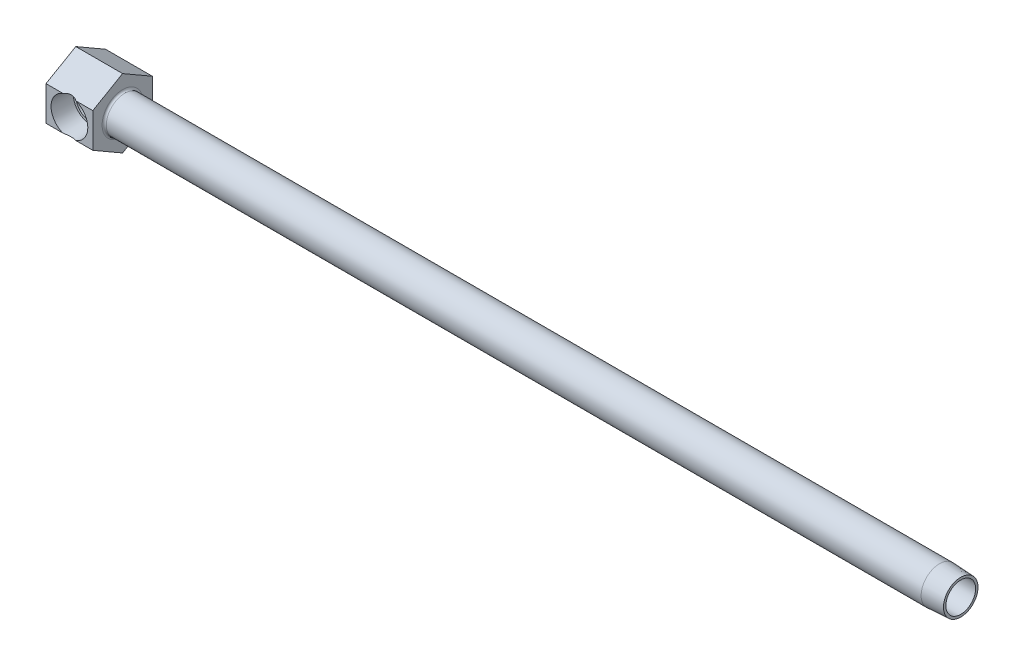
ISO-10303-21;
HEADER;
FILE_DESCRIPTION(('STEP AP214'),'2;1');
FILE_NAME('part.step','',(''),(''),'','','');
FILE_SCHEMA(('AUTOMOTIVE_DESIGN { 1 0 10303 214 1 1 1 1 }'));
ENDSEC;
DATA;
#1=APPLICATION_CONTEXT('core data for automotive mechanical design processes');
#2=APPLICATION_PROTOCOL_DEFINITION('international standard','automotive_design',2000,#1);
#3=PRODUCT_CONTEXT('',#1,'mechanical');
#4=PRODUCT('Part','Part','',(#3));
#5=PRODUCT_RELATED_PRODUCT_CATEGORY('part','',(#4));
#6=PRODUCT_DEFINITION_FORMATION('','',#4);
#7=PRODUCT_DEFINITION_CONTEXT('part definition',#1,'design');
#8=PRODUCT_DEFINITION('design','',#6,#7);
#9=PRODUCT_DEFINITION_SHAPE('','',#8);
#10=(LENGTH_UNIT() NAMED_UNIT(*) SI_UNIT(.MILLI.,.METRE.));
#11=(NAMED_UNIT(*) PLANE_ANGLE_UNIT() SI_UNIT($,.RADIAN.));
#12=(NAMED_UNIT(*) SI_UNIT($,.STERADIAN.) SOLID_ANGLE_UNIT());
#13=UNCERTAINTY_MEASURE_WITH_UNIT(LENGTH_MEASURE(1.E-05),#10,'distance_accuracy_value','');
#14=(GEOMETRIC_REPRESENTATION_CONTEXT(3) GLOBAL_UNCERTAINTY_ASSIGNED_CONTEXT((#13)) GLOBAL_UNIT_ASSIGNED_CONTEXT((#10,
#11,#12)) REPRESENTATION_CONTEXT('',''));
#15=CARTESIAN_POINT('',(0.,0.,0.));
#16=DIRECTION('',(0.,0.,1.));
#17=DIRECTION('',(1.,0.,0.));
#18=AXIS2_PLACEMENT_3D('',#15,#16,#17);
#19=CARTESIAN_POINT('',(63.5,0.,11.1125));
#20=DIRECTION('',(-1.,0.,0.));
#21=DIRECTION('',(0.,0.,1.));
#22=AXIS2_PLACEMENT_3D('',#19,#20,#21);
#23=CYLINDRICAL_SURFACE('',#22,6.858);
#24=CARTESIAN_POINT('',(18.2499,0.,11.1125));
#25=DIRECTION('',(-1.,0.,0.));
#26=DIRECTION('',(0.,-1.,0.));
#27=AXIS2_PLACEMENT_3D('',#24,#25,#26);
#28=CIRCLE('',#27,6.858);
#29=CARTESIAN_POINT('',(18.2499,-6.858,11.1125));
#30=VERTEX_POINT('',#29);
#31=EDGE_CURVE('E22',#30,#30,#28,.F.);
#32=ORIENTED_EDGE('',*,*,#31,.T.);
#33=EDGE_LOOP('',(#32));
#34=FACE_BOUND('',#33,.T.);
#35=CARTESIAN_POINT('',(322.2752,0.,11.1125));
#36=DIRECTION('',(1.,0.,0.));
#37=DIRECTION('',(0.,0.,-1.));
#38=AXIS2_PLACEMENT_3D('',#35,#36,#37);
#39=CIRCLE('',#38,6.858);
#40=CARTESIAN_POINT('',(322.2752,0.,4.2545));
#41=VERTEX_POINT('',#40);
#42=EDGE_CURVE('E156',#41,#41,#39,.T.);
#43=ORIENTED_EDGE('',*,*,#42,.F.);
#44=EDGE_LOOP('',(#43));
#45=FACE_BOUND('',#44,.T.);
#46=ADVANCED_FACE('F15',(#34,#45),#23,.T.);
#47=CARTESIAN_POINT('',(8.7376,0.,22.225));
#48=DIRECTION('',(0.,0.,1.));
#49=DIRECTION('',(1.,0.,0.));
#50=AXIS2_PLACEMENT_3D('',#47,#48,#49);
#51=CONICAL_SURFACE('',#50,6.858,0.0523598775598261);
#52=CARTESIAN_POINT('',(8.7376,-0.680996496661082,34.5170205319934));
#53=DIRECTION('',(0.,-0.866025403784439,-0.5));
#54=DIRECTION('',(0.,-0.5,0.866025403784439));
#55=AXIS2_PLACEMENT_3D('',#52,#53,#54);
#56=ELLIPSE('',#55,15.0043949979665,7.47122554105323);
#57=CARTESIAN_POINT('',(11.1603281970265,6.4158048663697,22.225));
#58=VERTEX_POINT('',#57);
#59=CARTESIAN_POINT('',(6.3148718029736,6.4158048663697,22.225));
#60=VERTEX_POINT('',#59);
#61=EDGE_CURVE('E232',#58,#60,#56,.F.);
#62=ORIENTED_EDGE('',*,*,#61,.T.);
#63=CARTESIAN_POINT('',(8.7376,0.,22.225));
#64=DIRECTION('',(0.,0.,-1.));
#65=DIRECTION('',(-1.,0.,0.));
#66=AXIS2_PLACEMENT_3D('',#63,#64,#65);
#67=CIRCLE('',#66,6.858);
#68=CARTESIAN_POINT('',(6.31487180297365,-6.41580486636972,22.225));
#69=VERTEX_POINT('',#68);
#70=EDGE_CURVE('E36',#69,#60,#67,.T.);
#71=ORIENTED_EDGE('',*,*,#70,.F.);
#72=CARTESIAN_POINT('',(8.7376,0.680996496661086,34.5170205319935));
#73=DIRECTION('',(0.,0.866025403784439,-0.5));
#74=DIRECTION('',(0.,0.5,0.866025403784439));
#75=AXIS2_PLACEMENT_3D('',#72,#73,#74);
#76=ELLIPSE('',#75,15.0043949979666,7.47122554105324);
#77=CARTESIAN_POINT('',(11.1603281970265,-6.4158048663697,22.225));
#78=VERTEX_POINT('',#77);
#79=EDGE_CURVE('E10',#69,#78,#76,.F.);
#80=ORIENTED_EDGE('',*,*,#79,.T.);
#81=EDGE_CURVE('E249',#58,#78,#67,.T.);
#82=ORIENTED_EDGE('',*,*,#81,.F.);
#83=EDGE_LOOP('',(#62,#71,#80,#82));
#84=FACE_BOUND('',#83,.T.);
#85=CARTESIAN_POINT('',(8.7376,0.,14.3002));
#86=DIRECTION('',(0.,0.,-1.));
#87=DIRECTION('',(-1.,0.,0.));
#88=AXIS2_PLACEMENT_3D('',#85,#86,#87);
#89=CIRCLE('',#88,6.44267883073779);
#90=CARTESIAN_POINT('',(13.3057672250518,-4.54312213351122,14.3002));
#91=VERTEX_POINT('',#90);
#92=CARTESIAN_POINT('',(13.3057672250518,4.54312213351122,14.3002));
#93=VERTEX_POINT('',#92);
#94=EDGE_CURVE('E251',#91,#93,#89,.T.);
#95=ORIENTED_EDGE('',*,*,#94,.T.);
#96=CARTESIAN_POINT('',(13.3056128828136,4.54326245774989,14.3));
#97=CARTESIAN_POINT('',(13.4050037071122,4.45290836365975,14.4287190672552));
#98=CARTESIAN_POINT('',(13.5038252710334,4.35690222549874,14.5539811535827));
#99=CARTESIAN_POINT('',(13.6989301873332,4.15324987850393,14.7972290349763));
#100=CARTESIAN_POINT('',(13.7952093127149,4.04558563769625,14.9152031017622));
#101=CARTESIAN_POINT('',(13.9843700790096,3.81752411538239,15.1441485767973));
#102=CARTESIAN_POINT('',(14.0772125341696,3.69701926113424,15.25504596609));
#103=CARTESIAN_POINT('',(14.2568464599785,3.44414434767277,15.4675620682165));
#104=CARTESIAN_POINT('',(14.3436418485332,3.31178210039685,15.5691868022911));
#105=CARTESIAN_POINT('',(14.5527686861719,2.962976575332,15.8122617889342));
#106=CARTESIAN_POINT('',(14.6701286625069,2.73858307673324,15.9469651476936));
#107=CARTESIAN_POINT('',(14.8276174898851,2.38307262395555,16.1264780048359));
#108=CARTESIAN_POINT('',(14.8769849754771,2.2615363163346,16.1825173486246));
#109=CARTESIAN_POINT('',(14.9687772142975,2.0125151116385,16.2864098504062));
#110=CARTESIAN_POINT('',(15.0112056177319,1.88503338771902,16.3342673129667));
#111=CARTESIAN_POINT('',(15.088733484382,1.6232487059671,16.4215218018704));
#112=CARTESIAN_POINT('',(15.1237419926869,1.48888366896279,16.4608139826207));
#113=CARTESIAN_POINT('',(15.1849785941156,1.21573970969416,16.5294343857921));
#114=CARTESIAN_POINT('',(15.2112114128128,1.0769632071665,16.5587679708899));
#115=CARTESIAN_POINT('',(15.2542466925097,0.796159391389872,16.6068431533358));
#116=CARTESIAN_POINT('',(15.2710505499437,0.654132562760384,16.6255863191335));
#117=CARTESIAN_POINT('',(15.2947665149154,0.368243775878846,16.6520290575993));
#118=CARTESIAN_POINT('',(15.3016803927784,0.22438215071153,16.6597306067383));
#119=CARTESIAN_POINT('',(15.3051381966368,-0.0413792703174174,16.6635827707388));
#120=CARTESIAN_POINT('',(15.3031178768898,-0.163241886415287,16.6613326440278));
#121=CARTESIAN_POINT('',(15.2919140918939,-0.406265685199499,16.6488476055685));
#122=CARTESIAN_POINT('',(15.282728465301,-0.527426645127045,16.6386102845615));
#123=CARTESIAN_POINT('',(15.2573805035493,-0.768029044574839,16.6103343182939));
#124=CARTESIAN_POINT('',(15.2412218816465,-0.88747136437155,16.5922998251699));
#125=CARTESIAN_POINT('',(15.2022471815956,-1.1238947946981,16.5487418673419));
#126=CARTESIAN_POINT('',(15.1794285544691,-1.24087494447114,16.5232155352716));
#127=CARTESIAN_POINT('',(15.1030013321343,-1.58064044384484,16.4375716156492));
#128=CARTESIAN_POINT('',(15.0406598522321,-1.79907617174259,16.3675454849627));
#129=CARTESIAN_POINT('',(14.8959772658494,-2.2198653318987,16.2041288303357));
#130=CARTESIAN_POINT('',(14.8136249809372,-2.42220969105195,16.1107252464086));
#131=CARTESIAN_POINT('',(14.6581620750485,-2.75475802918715,15.9330467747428));
#132=CARTESIAN_POINT('',(14.588877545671,-2.88934500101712,15.8534887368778));
#133=CARTESIAN_POINT('',(14.4433958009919,-3.14876465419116,15.6853070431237));
#134=CARTESIAN_POINT('',(14.3671982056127,-3.27359679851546,15.5966828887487));
#135=CARTESIAN_POINT('',(14.2091096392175,-3.51355050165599,15.4112660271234));
#136=CARTESIAN_POINT('',(14.1272094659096,-3.62865566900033,15.3144600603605));
#137=CARTESIAN_POINT('',(13.9591121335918,-3.84892561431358,15.1136697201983));
#138=CARTESIAN_POINT('',(13.8729164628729,-3.95409379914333,15.0096878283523));
#139=CARTESIAN_POINT('',(13.7069469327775,-4.14374167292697,14.806812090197));
#140=CARTESIAN_POINT('',(13.62749258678,-4.22922772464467,14.7085925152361));
#141=CARTESIAN_POINT('',(13.4673498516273,-4.39212627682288,14.5076746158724));
#142=CARTESIAN_POINT('',(13.386669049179,-4.46957495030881,14.404999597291));
#143=CARTESIAN_POINT('',(13.3056128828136,-4.54326245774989,14.3));
#144=B_SPLINE_CURVE_WITH_KNOTS('',3,(#96,#97,#98,#99,#100,#101,#102,#103,#104,#105,#106,#107,
#108,#109,#110,#111,#112,#113,#114,#115,#116,#117,#118,#119,#120,#121,#122,#123,#124,#125,#126,
#127,#128,#129,#130,#131,#132,#133,#134,#135,#136,#137,#138,#139,#140,#141,#142,#143),
.UNSPECIFIED.,.F.,.F.,(4,2,2,2,2,2,2,2,2,2,2,2,2,2,2,2,2,2,2,2,2,2,2,4),(0.,0.55807217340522,
1.11702021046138,1.68108674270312,2.24478434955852,3.10140634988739,3.52893103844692,
3.95623010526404,4.38849766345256,4.82053207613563,5.25250248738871,5.68439556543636,
6.04963287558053,6.41498039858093,6.78013360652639,7.14542675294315,7.85550743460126,
8.56598569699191,9.07835413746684,9.59075076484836,10.1039943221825,10.6170612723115,
11.0743952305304,11.5295724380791),.UNSPECIFIED.);
#145=EDGE_CURVE('E130',#93,#91,#144,.T.);
#146=ORIENTED_EDGE('',*,*,#145,.T.);
#147=EDGE_LOOP('',(#95,#146));
#148=FACE_BOUND('',#147,.T.);
#149=ADVANCED_FACE('F138',(#84,#148),#51,.F.);
#150=CARTESIAN_POINT('',(15.1802788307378,0.,14.3002));
#151=DIRECTION('',(0.,0.,1.));
#152=DIRECTION('',(1.,0.,0.));
#153=AXIS2_PLACEMENT_3D('',#150,#151,#152);
#154=PLANE('',#153);
#155=ORIENTED_EDGE('',*,*,#94,.F.);
#156=DIRECTION('',(1.,0.,0.));
#157=VECTOR('',#156,1.);
#158=CARTESIAN_POINT('',(65.6255637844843,-4.54312213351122,14.3002));
#159=LINE('',#158,#157);
#160=CARTESIAN_POINT('',(11.9253,-4.54312213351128,14.3002));
#161=VERTEX_POINT('',#160);
#162=EDGE_CURVE('E128',#91,#161,#159,.F.);
#163=ORIENTED_EDGE('',*,*,#162,.T.);
#164=CARTESIAN_POINT('',(8.7376,0.,14.3002));
#165=DIRECTION('',(0.,0.,-1.));
#166=DIRECTION('',(-1.,0.,0.));
#167=AXIS2_PLACEMENT_3D('',#164,#165,#166);
#168=CIRCLE('',#167,5.5499);
#169=CARTESIAN_POINT('',(11.9253,4.54312213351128,14.3002));
#170=VERTEX_POINT('',#169);
#171=EDGE_CURVE('E120',#161,#170,#168,.T.);
#172=ORIENTED_EDGE('',*,*,#171,.T.);
#173=DIRECTION('',(1.,0.,0.));
#174=VECTOR('',#173,1.);
#175=CARTESIAN_POINT('',(65.6255637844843,4.54312213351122,14.3002));
#176=LINE('',#175,#174);
#177=EDGE_CURVE('E123',#170,#93,#176,.T.);
#178=ORIENTED_EDGE('',*,*,#177,.T.);
#179=EDGE_LOOP('',(#155,#163,#172,#178));
#180=FACE_BOUND('',#179,.T.);
#181=ADVANCED_FACE('F181',(#180),#154,.T.);
#182=CARTESIAN_POINT('',(8.7376,0.,27.6280516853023));
#183=DIRECTION('',(0.,0.,-1.));
#184=DIRECTION('',(-1.,0.,0.));
#185=AXIS2_PLACEMENT_3D('',#182,#183,#184);
#186=CYLINDRICAL_SURFACE('',#185,5.5499);
#187=ORIENTED_EDGE('',*,*,#171,.F.);
#188=CARTESIAN_POINT('',(8.7376,0.,11.1125));
#189=DIRECTION('',(0.707106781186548,0.,-0.707106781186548));
#190=DIRECTION('',(-0.707106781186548,0.,-0.707106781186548));
#191=AXIS2_PLACEMENT_3D('',#188,#189,#190);
#192=ELLIPSE('',#191,7.84874384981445,5.5499);
#193=CARTESIAN_POINT('',(8.7376,-5.5499,11.1125));
#194=VERTEX_POINT('',#193);
#195=EDGE_CURVE('E109',#161,#194,#192,.T.);
#196=ORIENTED_EDGE('',*,*,#195,.T.);
#197=CARTESIAN_POINT('',(8.7376,0.,11.1125));
#198=DIRECTION('',(-0.707106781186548,0.,-0.707106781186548));
#199=DIRECTION('',(0.707106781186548,0.,-0.707106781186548));
#200=AXIS2_PLACEMENT_3D('',#197,#198,#199);
#201=ELLIPSE('',#200,7.84874384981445,5.5499);
#202=CARTESIAN_POINT('',(13.4708637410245,-2.89786203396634,6.37923625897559));
#203=VERTEX_POINT('',#202);
#204=EDGE_CURVE('E104',#194,#203,#201,.F.);
#205=ORIENTED_EDGE('',*,*,#204,.T.);
#206=CARTESIAN_POINT('',(8.7376,0.,6.37923625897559));
#207=DIRECTION('',(0.,0.,-1.));
#208=DIRECTION('',(-1.,0.,0.));
#209=AXIS2_PLACEMENT_3D('',#206,#207,#208);
#210=CIRCLE('',#209,5.5499);
#211=CARTESIAN_POINT('',(13.4708637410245,2.89786203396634,6.37923625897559));
#212=VERTEX_POINT('',#211);
#213=EDGE_CURVE('E136',#203,#212,#210,.T.);
#214=ORIENTED_EDGE('',*,*,#213,.T.);
#215=CARTESIAN_POINT('',(8.7376,5.5499,11.1125));
#216=VERTEX_POINT('',#215);
#217=EDGE_CURVE('E29',#212,#216,#201,.F.);
#218=ORIENTED_EDGE('',*,*,#217,.T.);
#219=EDGE_CURVE('E121',#216,#170,#192,.T.);
#220=ORIENTED_EDGE('',*,*,#219,.T.);
#221=EDGE_LOOP('',(#187,#196,#205,#214,#218,#220));
#222=FACE_BOUND('',#221,.T.);
#223=ADVANCED_FACE('F117',(#222),#186,.F.);
#224=CARTESIAN_POINT('',(8.7376,0.,6.37923625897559));
#225=DIRECTION('',(0.,0.,1.));
#226=DIRECTION('',(1.,0.,0.));
#227=AXIS2_PLACEMENT_3D('',#224,#225,#226);
#228=CONICAL_SURFACE('',#227,5.5499,1.04719755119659);
#229=CARTESIAN_POINT('',(8.7376,0.,3.175));
#230=VERTEX_POINT('',#229);
#231=VERTEX_LOOP('',#230);
#232=FACE_BOUND('',#231,.T.);
#233=ORIENTED_EDGE('',*,*,#213,.F.);
#234=CARTESIAN_POINT('',(13.4710699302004,-2.89818868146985,6.37943625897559));
#235=CARTESIAN_POINT('',(13.420685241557,-2.8185279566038,6.33063423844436));
#236=CARTESIAN_POINT('',(13.3737513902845,-2.73601453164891,6.2828976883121));
#237=CARTESIAN_POINT('',(13.2869939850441,-2.56583570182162,6.19038737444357));
#238=CARTESIAN_POINT('',(13.2471660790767,-2.47817349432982,6.14561180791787));
#239=CARTESIAN_POINT('',(13.1751547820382,-2.29911606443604,6.06025322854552));
#240=CARTESIAN_POINT('',(13.1428940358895,-2.20777091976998,6.01963042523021));
#241=CARTESIAN_POINT('',(13.0851463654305,-2.02119544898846,5.94274790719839));
#242=CARTESIAN_POINT('',(13.0596596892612,-1.92596498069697,5.90648835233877));
#243=CARTESIAN_POINT('',(13.0148514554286,-1.73255643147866,5.83897057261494));
#244=CARTESIAN_POINT('',(12.9955185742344,-1.63438413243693,5.80770321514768));
#245=CARTESIAN_POINT('',(12.9620830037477,-1.4356334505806,5.75050007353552));
#246=CARTESIAN_POINT('',(12.9479806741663,-1.33505490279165,5.72456465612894));
#247=CARTESIAN_POINT('',(12.9240526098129,-1.13183172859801,5.67823452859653));
#248=CARTESIAN_POINT('',(12.9142392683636,-1.0291819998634,5.65785593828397));
#249=CARTESIAN_POINT('',(12.8981074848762,-0.822623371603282,5.62290462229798));
#250=CARTESIAN_POINT('',(12.891789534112,-0.718714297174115,5.60833271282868));
#251=CARTESIAN_POINT('',(12.8810293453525,-0.489671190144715,5.58281999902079));
#252=CARTESIAN_POINT('',(12.8771967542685,-0.364365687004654,5.57314917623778));
#253=CARTESIAN_POINT('',(12.8729275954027,-0.113319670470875,5.56233429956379));
#254=CARTESIAN_POINT('',(12.8724915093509,0.0124209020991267,5.56119145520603));
#255=CARTESIAN_POINT('',(12.874939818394,0.263686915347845,5.567443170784));
#256=CARTESIAN_POINT('',(12.8778249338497,0.389212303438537,5.57483958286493));
#257=CARTESIAN_POINT('',(12.8874191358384,0.639322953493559,5.59811647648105));
#258=CARTESIAN_POINT('',(12.8941278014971,0.763908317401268,5.61399602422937));
#259=CARTESIAN_POINT('',(12.9116197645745,1.00072761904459,5.65236645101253));
#260=CARTESIAN_POINT('',(12.9220027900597,1.11310193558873,5.6741708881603));
#261=CARTESIAN_POINT('',(12.9479188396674,1.33574469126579,5.72453194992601));
#262=CARTESIAN_POINT('',(12.9634519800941,1.44601308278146,5.75308872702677));
#263=CARTESIAN_POINT('',(13.00082798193,1.66326683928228,5.81649299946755));
#264=CARTESIAN_POINT('',(13.022650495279,1.77026157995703,5.85132007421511));
#265=CARTESIAN_POINT('',(13.0737132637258,1.98033019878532,5.92673676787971));
#266=CARTESIAN_POINT('',(13.1029503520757,2.08340572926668,5.96732392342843));
#267=CARTESIAN_POINT('',(13.1785970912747,2.31167706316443,6.06504898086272));
#268=CARTESIAN_POINT('',(13.2275080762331,2.43541928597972,6.12371071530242));
#269=CARTESIAN_POINT('',(13.3111431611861,2.61414296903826,6.21635789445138));
#270=CARTESIAN_POINT('',(13.3408272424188,2.67271819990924,6.24810824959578));
#271=CARTESIAN_POINT('',(13.4034989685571,2.78735967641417,6.31288069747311));
#272=CARTESIAN_POINT('',(13.4364871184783,2.8434255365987,6.34590298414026));
#273=CARTESIAN_POINT('',(13.4710699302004,2.89818868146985,6.37943625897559));
#274=B_SPLINE_CURVE_WITH_KNOTS('',3,(#234,#235,#236,#237,#238,#239,#240,#241,#242,#243,#244,
#245,#246,#247,#248,#249,#250,#251,#252,#253,#254,#255,#256,#257,#258,#259,#260,#261,#262,#263,
#264,#265,#266,#267,#268,#269,#270,#271,#272,#273),.UNSPECIFIED.,.F.,.F.,(4,2,2,2,2,2,2,2,2,2,2,
2,2,2,2,2,2,2,2,4),(0.,0.318348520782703,0.636501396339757,0.951244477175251,1.26599908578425,
1.58017112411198,1.89436476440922,2.20946038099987,2.52460027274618,2.90145665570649,
3.27836648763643,3.65535808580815,4.03230819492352,4.37682355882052,4.72134670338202,
5.06476748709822,5.40804184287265,5.84309066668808,6.06180090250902,6.28054461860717),.UNSPECIFIED.);
#275=EDGE_CURVE('E111',#203,#212,#274,.T.);
#276=ORIENTED_EDGE('',*,*,#275,.T.);
#277=EDGE_LOOP('',(#233,#276));
#278=FACE_BOUND('',#277,.T.);
#279=ADVANCED_FACE('F148',(#232,#278),#228,.F.);
#280=CARTESIAN_POINT('',(17.4625,12.8316097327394,11.1125));
#281=DIRECTION('',(0.,-0.866025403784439,-0.5));
#282=DIRECTION('',(0.,0.5,-0.866025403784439));
#283=AXIS2_PLACEMENT_3D('',#280,#281,#282);
#284=PLANE('',#283);
#285=ORIENTED_EDGE('',*,*,#61,.F.);
#286=DIRECTION('',(-1.,0.,0.));
#287=VECTOR('',#286,1.);
#288=CARTESIAN_POINT('',(17.4625,6.4158048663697,22.225));
#289=LINE('',#288,#287);
#290=CARTESIAN_POINT('',(17.4625,6.4158048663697,22.225));
#291=VERTEX_POINT('',#290);
#292=EDGE_CURVE('E202',#291,#58,#289,.T.);
#293=ORIENTED_EDGE('',*,*,#292,.F.);
#294=DIRECTION('',(0.,-0.5,0.866025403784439));
#295=VECTOR('',#294,1.);
#296=CARTESIAN_POINT('',(17.4625,12.8316097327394,11.1125));
#297=LINE('',#296,#295);
#298=CARTESIAN_POINT('',(17.4625,12.8316097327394,11.1125));
#299=VERTEX_POINT('',#298);
#300=EDGE_CURVE('E222',#299,#291,#297,.T.);
#301=ORIENTED_EDGE('',*,*,#300,.F.);
#302=DIRECTION('',(-1.,0.,0.));
#303=VECTOR('',#302,1.);
#304=CARTESIAN_POINT('',(17.4625,12.8316097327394,11.1125));
#305=LINE('',#304,#303);
#306=CARTESIAN_POINT('',(0.,12.8316097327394,11.1125));
#307=VERTEX_POINT('',#306);
#308=EDGE_CURVE('E199',#299,#307,#305,.T.);
#309=ORIENTED_EDGE('',*,*,#308,.T.);
#310=DIRECTION('',(0.,-0.5,0.866025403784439));
#311=VECTOR('',#310,1.);
#312=CARTESIAN_POINT('',(0.,12.8316097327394,11.1125));
#313=LINE('',#312,#311);
#314=CARTESIAN_POINT('',(0.,6.4158048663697,22.225));
#315=VERTEX_POINT('',#314);
#316=EDGE_CURVE('E239',#307,#315,#313,.T.);
#317=ORIENTED_EDGE('',*,*,#316,.T.);
#318=EDGE_CURVE('E205',#60,#315,#289,.T.);
#319=ORIENTED_EDGE('',*,*,#318,.F.);
#320=EDGE_LOOP('',(#285,#293,#301,#309,#317,#319));
#321=FACE_BOUND('',#320,.T.);
#322=ADVANCED_FACE('F256',(#321),#284,.F.);
#323=CARTESIAN_POINT('',(17.4625,6.4158048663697,22.225));
#324=DIRECTION('',(0.,0.,-1.));
#325=DIRECTION('',(0.,1.,0.));
#326=AXIS2_PLACEMENT_3D('',#323,#324,#325);
#327=PLANE('',#326);
#328=ORIENTED_EDGE('',*,*,#70,.T.);
#329=ORIENTED_EDGE('',*,*,#318,.T.);
#330=DIRECTION('',(0.,-1.,0.));
#331=VECTOR('',#330,1.);
#332=CARTESIAN_POINT('',(0.,6.4158048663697,22.225));
#333=LINE('',#332,#331);
#334=CARTESIAN_POINT('',(0.,-6.41580486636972,22.225));
#335=VERTEX_POINT('',#334);
#336=EDGE_CURVE('E235',#315,#335,#333,.T.);
#337=ORIENTED_EDGE('',*,*,#336,.T.);
#338=DIRECTION('',(-1.,0.,0.));
#339=VECTOR('',#338,1.);
#340=CARTESIAN_POINT('',(17.4625,-6.41580486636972,22.225));
#341=LINE('',#340,#339);
#342=EDGE_CURVE('E209',#69,#335,#341,.T.);
#343=ORIENTED_EDGE('',*,*,#342,.F.);
#344=EDGE_LOOP('',(#328,#329,#337,#343));
#345=FACE_BOUND('',#344,.T.);
#346=ADVANCED_FACE('F263',(#345),#327,.F.);
#347=ORIENTED_EDGE('',*,*,#81,.T.);
#348=CARTESIAN_POINT('',(17.4625,-6.41580486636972,22.225));
#349=VERTEX_POINT('',#348);
#350=EDGE_CURVE('E206',#349,#78,#341,.T.);
#351=ORIENTED_EDGE('',*,*,#350,.F.);
#352=DIRECTION('',(0.,-1.,0.));
#353=VECTOR('',#352,1.);
#354=CARTESIAN_POINT('',(17.4625,6.4158048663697,22.225));
#355=LINE('',#354,#353);
#356=EDGE_CURVE('E220',#291,#349,#355,.T.);
#357=ORIENTED_EDGE('',*,*,#356,.F.);
#358=ORIENTED_EDGE('',*,*,#292,.T.);
#359=EDGE_LOOP('',(#347,#351,#357,#358));
#360=FACE_BOUND('',#359,.T.);
#361=ADVANCED_FACE('F287',(#360),#327,.F.);
#362=CARTESIAN_POINT('',(17.4625,-6.41580486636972,22.225));
#363=DIRECTION('',(0.,0.866025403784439,-0.5));
#364=DIRECTION('',(0.,0.5,0.866025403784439));
#365=AXIS2_PLACEMENT_3D('',#362,#363,#364);
#366=PLANE('',#365);
#367=ORIENTED_EDGE('',*,*,#79,.F.);
#368=ORIENTED_EDGE('',*,*,#342,.T.);
#369=DIRECTION('',(0.,-0.5,-0.866025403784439));
#370=VECTOR('',#369,1.);
#371=CARTESIAN_POINT('',(0.,-6.41580486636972,22.225));
#372=LINE('',#371,#370);
#373=CARTESIAN_POINT('',(0.,-12.8316097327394,11.1125));
#374=VERTEX_POINT('',#373);
#375=EDGE_CURVE('E218',#335,#374,#372,.T.);
#376=ORIENTED_EDGE('',*,*,#375,.T.);
#377=DIRECTION('',(-1.,0.,0.));
#378=VECTOR('',#377,1.);
#379=CARTESIAN_POINT('',(17.4625,-12.8316097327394,11.1125));
#380=LINE('',#379,#378);
#381=CARTESIAN_POINT('',(17.4625,-12.8316097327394,11.1125));
#382=VERTEX_POINT('',#381);
#383=EDGE_CURVE('E210',#382,#374,#380,.T.);
#384=ORIENTED_EDGE('',*,*,#383,.F.);
#385=DIRECTION('',(0.,-0.5,-0.866025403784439));
#386=VECTOR('',#385,1.);
#387=CARTESIAN_POINT('',(17.4625,-6.41580486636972,22.225));
#388=LINE('',#387,#386);
#389=EDGE_CURVE('E213',#349,#382,#388,.T.);
#390=ORIENTED_EDGE('',*,*,#389,.F.);
#391=ORIENTED_EDGE('',*,*,#350,.T.);
#392=EDGE_LOOP('',(#367,#368,#376,#384,#390,#391));
#393=FACE_BOUND('',#392,.T.);
#394=ADVANCED_FACE('F283',(#393),#366,.F.);
#395=CARTESIAN_POINT('',(17.4625,-12.8316097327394,11.1125));
#396=DIRECTION('',(0.,0.866025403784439,0.5));
#397=DIRECTION('',(0.,-0.5,0.866025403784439));
#398=AXIS2_PLACEMENT_3D('',#395,#396,#397);
#399=PLANE('',#398);
#400=DIRECTION('',(0.,0.5,-0.866025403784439));
#401=VECTOR('',#400,1.);
#402=CARTESIAN_POINT('',(0.,-12.8316097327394,11.1125));
#403=LINE('',#402,#401);
#404=CARTESIAN_POINT('',(0.,-6.41580486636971,0.));
#405=VERTEX_POINT('',#404);
#406=EDGE_CURVE('E227',#374,#405,#403,.T.);
#407=ORIENTED_EDGE('',*,*,#406,.T.);
#408=DIRECTION('',(-1.,0.,0.));
#409=VECTOR('',#408,1.);
#410=CARTESIAN_POINT('',(17.4625,-6.41580486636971,0.));
#411=LINE('',#410,#409);
#412=CARTESIAN_POINT('',(17.4625,-6.41580486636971,0.));
#413=VERTEX_POINT('',#412);
#414=EDGE_CURVE('E191',#413,#405,#411,.T.);
#415=ORIENTED_EDGE('',*,*,#414,.F.);
#416=DIRECTION('',(0.,0.5,-0.866025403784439));
#417=VECTOR('',#416,1.);
#418=CARTESIAN_POINT('',(17.4625,-12.8316097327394,11.1125));
#419=LINE('',#418,#417);
#420=EDGE_CURVE('E214',#382,#413,#419,.T.);
#421=ORIENTED_EDGE('',*,*,#420,.F.);
#422=ORIENTED_EDGE('',*,*,#383,.T.);
#423=EDGE_LOOP('',(#407,#415,#421,#422));
#424=FACE_BOUND('',#423,.T.);
#425=ADVANCED_FACE('F286',(#424),#399,.F.);
#426=CARTESIAN_POINT('',(17.4625,-6.41580486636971,0.));
#427=DIRECTION('',(0.,0.,1.));
#428=DIRECTION('',(1.,0.,0.));
#429=AXIS2_PLACEMENT_3D('',#426,#427,#428);
#430=PLANE('',#429);
#431=DIRECTION('',(0.,1.,0.));
#432=VECTOR('',#431,1.);
#433=CARTESIAN_POINT('',(0.,-6.41580486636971,0.));
#434=LINE('',#433,#432);
#435=CARTESIAN_POINT('',(0.,6.41580486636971,0.));
#436=VERTEX_POINT('',#435);
#437=EDGE_CURVE('E231',#405,#436,#434,.T.);
#438=ORIENTED_EDGE('',*,*,#437,.T.);
#439=DIRECTION('',(-1.,0.,0.));
#440=VECTOR('',#439,1.);
#441=CARTESIAN_POINT('',(17.4625,6.41580486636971,0.));
#442=LINE('',#441,#440);
#443=CARTESIAN_POINT('',(17.4625,6.41580486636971,0.));
#444=VERTEX_POINT('',#443);
#445=EDGE_CURVE('E196',#444,#436,#442,.T.);
#446=ORIENTED_EDGE('',*,*,#445,.F.);
#447=DIRECTION('',(0.,1.,0.));
#448=VECTOR('',#447,1.);
#449=CARTESIAN_POINT('',(17.4625,-6.41580486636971,0.));
#450=LINE('',#449,#448);
#451=EDGE_CURVE('E217',#413,#444,#450,.T.);
#452=ORIENTED_EDGE('',*,*,#451,.F.);
#453=ORIENTED_EDGE('',*,*,#414,.T.);
#454=EDGE_LOOP('',(#438,#446,#452,#453));
#455=FACE_BOUND('',#454,.T.);
#456=ADVANCED_FACE('F294',(#455),#430,.F.);
#457=CARTESIAN_POINT('',(17.4625,6.4158048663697,0.));
#458=DIRECTION('',(0.,-0.866025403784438,0.5));
#459=DIRECTION('',(0.,-0.5,-0.866025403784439));
#460=AXIS2_PLACEMENT_3D('',#457,#458,#459);
#461=PLANE('',#460);
#462=DIRECTION('',(0.,0.5,0.866025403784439));
#463=VECTOR('',#462,1.);
#464=CARTESIAN_POINT('',(0.,6.4158048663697,0.));
#465=LINE('',#464,#463);
#466=EDGE_CURVE('E243',#436,#307,#465,.T.);
#467=ORIENTED_EDGE('',*,*,#466,.T.);
#468=ORIENTED_EDGE('',*,*,#308,.F.);
#469=DIRECTION('',(0.,0.5,0.866025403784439));
#470=VECTOR('',#469,1.);
#471=CARTESIAN_POINT('',(17.4625,6.4158048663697,0.));
#472=LINE('',#471,#470);
#473=EDGE_CURVE('E224',#444,#299,#472,.T.);
#474=ORIENTED_EDGE('',*,*,#473,.F.);
#475=ORIENTED_EDGE('',*,*,#445,.T.);
#476=EDGE_LOOP('',(#467,#468,#474,#475));
#477=FACE_BOUND('',#476,.T.);
#478=ADVANCED_FACE('F281',(#477),#461,.F.);
#479=CARTESIAN_POINT('',(17.4625,-19.2474145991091,22.225));
#480=DIRECTION('',(-1.,0.,0.));
#481=DIRECTION('',(0.,-1.,0.));
#482=AXIS2_PLACEMENT_3D('',#479,#480,#481);
#483=PLANE('',#482);
#484=CARTESIAN_POINT('',(17.4625,0.,11.1125));
#485=DIRECTION('',(-1.,0.,0.));
#486=DIRECTION('',(0.,-1.,0.));
#487=AXIS2_PLACEMENT_3D('',#484,#485,#486);
#488=CIRCLE('',#487,7.6454);
#489=CARTESIAN_POINT('',(17.4625,-7.6454,11.1125));
#490=VERTEX_POINT('',#489);
#491=EDGE_CURVE('E189',#490,#490,#488,.T.);
#492=ORIENTED_EDGE('',*,*,#491,.T.);
#493=EDGE_LOOP('',(#492));
#494=FACE_BOUND('',#493,.T.);
#495=ORIENTED_EDGE('',*,*,#420,.T.);
#496=ORIENTED_EDGE('',*,*,#451,.T.);
#497=ORIENTED_EDGE('',*,*,#473,.T.);
#498=ORIENTED_EDGE('',*,*,#300,.T.);
#499=ORIENTED_EDGE('',*,*,#356,.T.);
#500=ORIENTED_EDGE('',*,*,#389,.T.);
#501=EDGE_LOOP('',(#495,#496,#497,#498,#499,#500));
#502=FACE_BOUND('',#501,.T.);
#503=ADVANCED_FACE('F277',(#494,#502),#483,.F.);
#504=CARTESIAN_POINT('',(0.,-19.2474145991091,22.225));
#505=DIRECTION('',(-1.,0.,0.));
#506=DIRECTION('',(0.,-1.,0.));
#507=AXIS2_PLACEMENT_3D('',#504,#505,#506);
#508=PLANE('',#507);
#509=ORIENTED_EDGE('',*,*,#406,.F.);
#510=ORIENTED_EDGE('',*,*,#375,.F.);
#511=ORIENTED_EDGE('',*,*,#336,.F.);
#512=ORIENTED_EDGE('',*,*,#316,.F.);
#513=ORIENTED_EDGE('',*,*,#466,.F.);
#514=ORIENTED_EDGE('',*,*,#437,.F.);
#515=EDGE_LOOP('',(#509,#510,#511,#512,#513,#514));
#516=FACE_BOUND('',#515,.T.);
#517=ADVANCED_FACE('F274',(#516),#508,.T.);
#518=CARTESIAN_POINT('',(18.2499,0.,11.1125));
#519=DIRECTION('',(-1.,0.,0.));
#520=DIRECTION('',(0.,-1.,0.));
#521=AXIS2_PLACEMENT_3D('',#518,#519,#520);
#522=TOROIDAL_SURFACE('',#521,7.6454,0.7874);
#523=ORIENTED_EDGE('',*,*,#31,.F.);
#524=EDGE_LOOP('',(#523));
#525=FACE_BOUND('',#524,.T.);
#526=ORIENTED_EDGE('',*,*,#491,.F.);
#527=EDGE_LOOP('',(#526));
#528=FACE_BOUND('',#527,.T.);
#529=ADVANCED_FACE('F146',(#525,#528),#522,.F.);
#530=CARTESIAN_POINT('',(65.6255637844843,0.,11.1125));
#531=DIRECTION('',(1.,0.,0.));
#532=DIRECTION('',(0.,0.,-1.));
#533=AXIS2_PLACEMENT_3D('',#530,#531,#532);
#534=CYLINDRICAL_SURFACE('',#533,5.5499);
#535=ORIENTED_EDGE('',*,*,#177,.F.);
#536=ORIENTED_EDGE('',*,*,#219,.F.);
#537=ORIENTED_EDGE('',*,*,#217,.F.);
#538=ORIENTED_EDGE('',*,*,#275,.F.);
#539=ORIENTED_EDGE('',*,*,#204,.F.);
#540=ORIENTED_EDGE('',*,*,#195,.F.);
#541=ORIENTED_EDGE('',*,*,#162,.F.);
#542=ORIENTED_EDGE('',*,*,#145,.F.);
#543=EDGE_LOOP('',(#535,#536,#537,#538,#539,#540,#541,#542));
#544=FACE_BOUND('',#543,.T.);
#545=CARTESIAN_POINT('',(330.2,0.,11.1125));
#546=DIRECTION('',(1.,0.,0.));
#547=DIRECTION('',(0.,0.,-1.));
#548=AXIS2_PLACEMENT_3D('',#545,#546,#547);
#549=CIRCLE('',#548,5.5499);
#550=CARTESIAN_POINT('',(330.2,0.,5.5626));
#551=VERTEX_POINT('',#550);
#552=EDGE_CURVE('E162',#551,#551,#549,.T.);
#553=ORIENTED_EDGE('',*,*,#552,.T.);
#554=EDGE_LOOP('',(#553));
#555=FACE_BOUND('',#554,.T.);
#556=ADVANCED_FACE('F106',(#544,#555),#534,.F.);
#557=CARTESIAN_POINT('',(330.2,0.,11.1125));
#558=DIRECTION('',(-1.,0.,0.));
#559=DIRECTION('',(0.,0.,1.));
#560=AXIS2_PLACEMENT_3D('',#557,#558,#559);
#561=CONICAL_SURFACE('',#560,6.44267883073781,0.052359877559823);
#562=ORIENTED_EDGE('',*,*,#42,.T.);
#563=EDGE_LOOP('',(#562));
#564=FACE_BOUND('',#563,.T.);
#565=CARTESIAN_POINT('',(330.2,0.,11.1125));
#566=DIRECTION('',(1.,0.,0.));
#567=DIRECTION('',(0.,0.,-1.));
#568=AXIS2_PLACEMENT_3D('',#565,#566,#567);
#569=CIRCLE('',#568,6.44267883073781);
#570=CARTESIAN_POINT('',(330.2,0.,4.66982116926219));
#571=VERTEX_POINT('',#570);
#572=EDGE_CURVE('E159',#571,#571,#569,.T.);
#573=ORIENTED_EDGE('',*,*,#572,.F.);
#574=EDGE_LOOP('',(#573));
#575=FACE_BOUND('',#574,.T.);
#576=ADVANCED_FACE('F145',(#564,#575),#561,.T.);
#577=CARTESIAN_POINT('',(330.2,0.,5.5626));
#578=DIRECTION('',(1.,0.,0.));
#579=DIRECTION('',(0.,0.,-1.));
#580=AXIS2_PLACEMENT_3D('',#577,#578,#579);
#581=PLANE('',#580);
#582=ORIENTED_EDGE('',*,*,#572,.T.);
#583=EDGE_LOOP('',(#582));
#584=FACE_BOUND('',#583,.T.);
#585=ORIENTED_EDGE('',*,*,#552,.F.);
#586=EDGE_LOOP('',(#585));
#587=FACE_BOUND('',#586,.T.);
#588=ADVANCED_FACE('F166',(#584,#587),#581,.T.);
#589=CLOSED_SHELL('',(#46,#149,#181,#223,#279,#322,#346,#361,#394,#425,#456,#478,#503,#517,#529,
#556,#576,#588));
#590=MANIFOLD_SOLID_BREP('B1',#589);
#591=ADVANCED_BREP_SHAPE_REPRESENTATION('',(#18,#590),#14);
#592=SHAPE_DEFINITION_REPRESENTATION(#9,#591);
ENDSEC;
END-ISO-10303-21;
